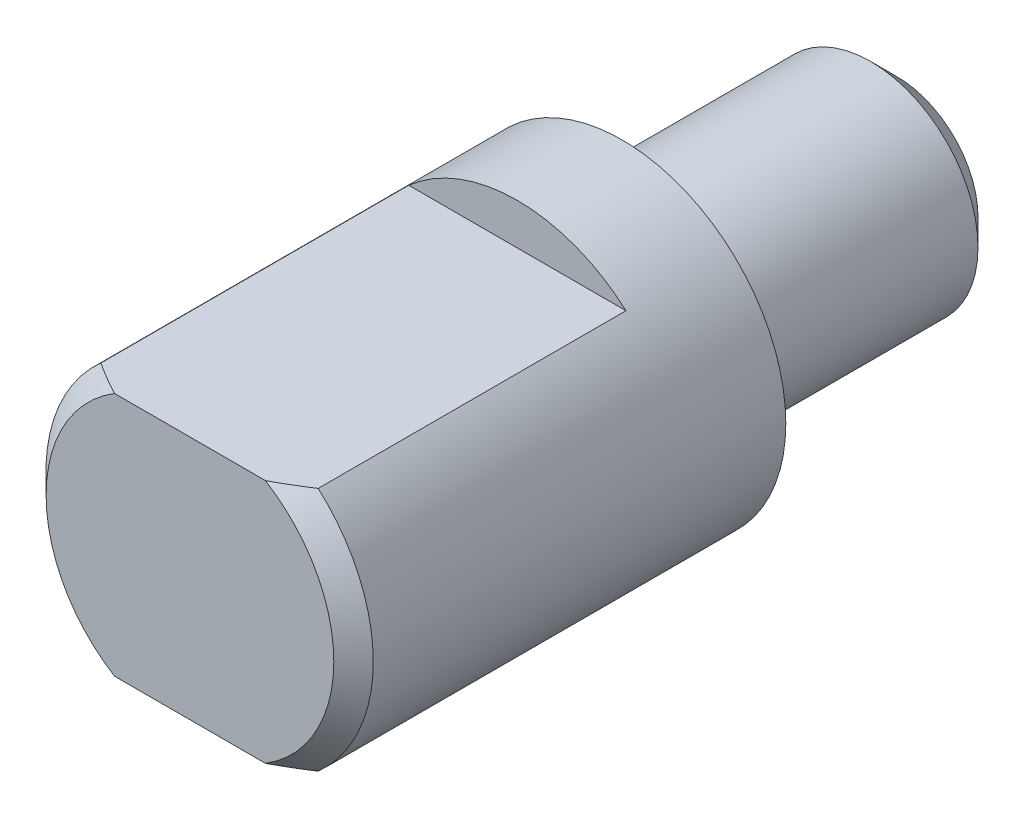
from build123d import *

# Parameters (mm, degrees)
SKETCH2_W          = 6.35
SKETCH2_H          = 0.8
CUT_EXTRUDE1_DEPTH = 5


with BuildPart() as part:
    # Sketch1 → Revolve1 (revolve)
    with BuildSketch(Plane(origin=(0, 0, 0), x_dir=(0, 0, -1), z_dir=(1, 0, 0)), mode=Mode.PRIVATE) as revolve1_sk:
        Polygon((9.648, 1.5728), (9.138, 2.0828), (4.318, 2.0828), (4.318, 3.175), (-3.684, 3.175), (-4.064, 2.79), (-4.064, 0), (9.648, 0), align=None)
    revolve(revolve1_sk.sketch.rotate(Axis((0, 0, 4.064), (0, 0, -1)), 90), axis=Axis((0, 0, 4.064), (0, 0, -1)))

    # Sketch2 → Cut-Extrude1 (cut, symmetric)
    with BuildSketch(Plane(origin=(0, 0, 0), x_dir=(0, 0, -1), z_dir=(1, 0, 0))):
        with Locations((-0.889, 2.775)):
            Rectangle(SKETCH2_W, SKETCH2_H)
        with Locations((-0.889, -2.775)):
            Rectangle(SKETCH2_W, SKETCH2_H)
    extrude(amount=CUT_EXTRUDE1_DEPTH, both=True, mode=Mode.SUBTRACT)


solid = part.part
